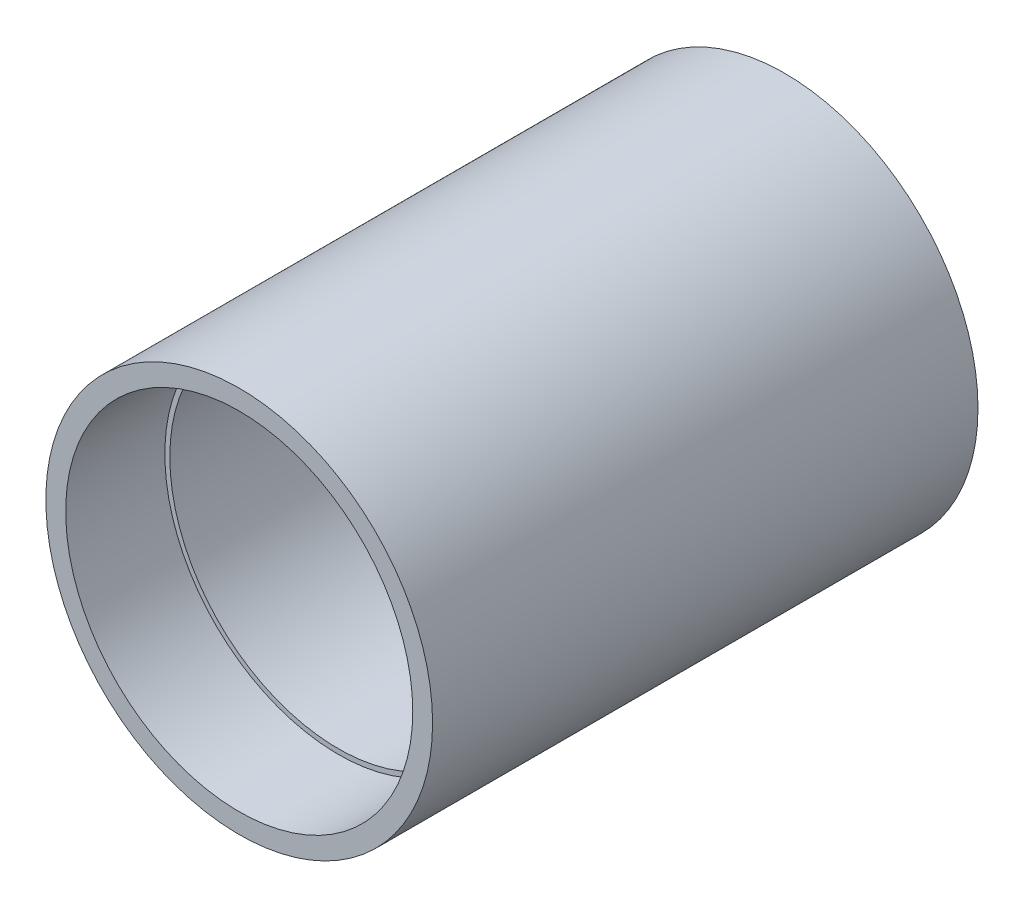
from build123d import *

# Parameters (mm, degrees)
ESQUISSE1_R             = 19.5
ESQUISSE1_R_2           = 17
EXTRUSION1_DEPTH        = 55
ESQUISSE2_R             = 17.5
ENL_V_MAT_EXTRU_1_DEPTH = 10
ENL_V_START             = -10
ESQUISSE3_R             = 17.5
ENL_V_MAT_EXTRU_2_DEPTH = 10


with BuildPart() as part:
    # Esquisse1 → Extrusion1 (new body)
    with BuildSketch(Plane.XY):
        Circle(ESQUISSE1_R)
        Circle(ESQUISSE1_R_2, mode=Mode.SUBTRACT)
    extrude(amount=EXTRUSION1_DEPTH)

    # Esquisse2 → Enl_v. mat.-Extru.1 (cut)
    with BuildSketch(Plane.XY.offset(55)):
        Circle(ESQUISSE2_R)
    extrude(amount=-ENL_V_MAT_EXTRU_1_DEPTH, mode=Mode.SUBTRACT)

    # Esquisse3 → Enl_v. mat.-Extru.2 (cut)
    with BuildSketch(Plane(origin=(0, 0, 0), x_dir=(-1, 0, 0), z_dir=(0, 0, -1)).offset(ENL_V_START)):
        with Locations(Location((0, 0, 0), (0, 0, 180))):
            Circle(ESQUISSE3_R)
    extrude(amount=ENL_V_MAT_EXTRU_2_DEPTH, mode=Mode.SUBTRACT)


solid = part.part
